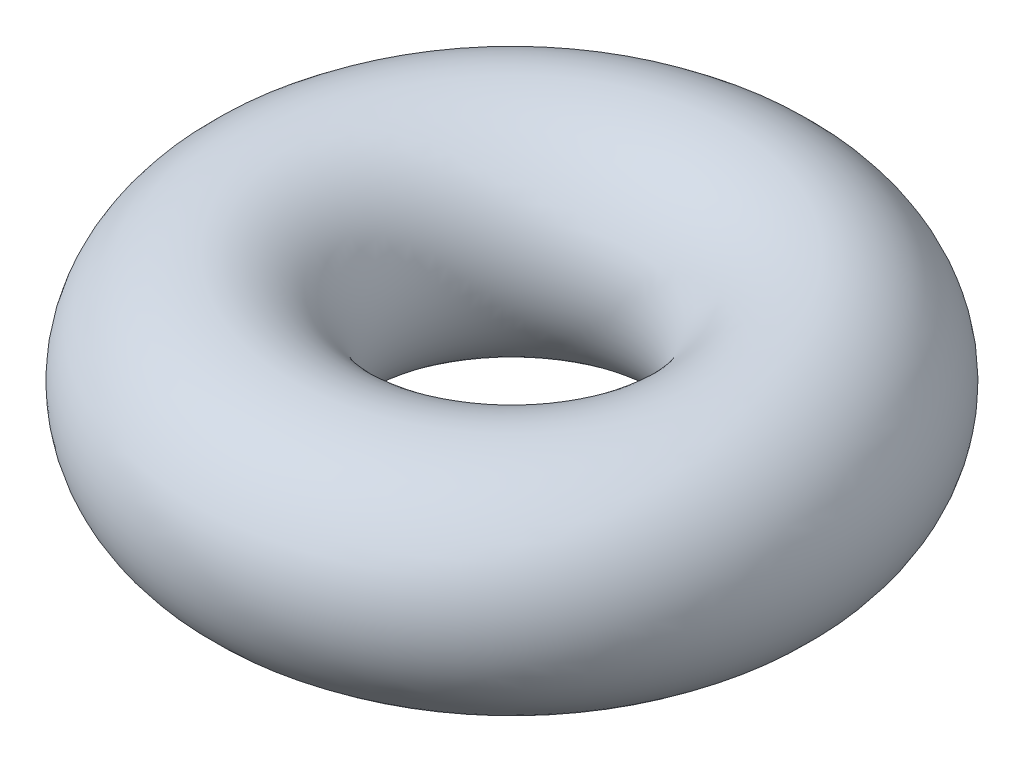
from build123d import *

# Parameters (mm, degrees)
SKETCH1_R = 0.889


with BuildPart() as part:
    # Sketch1 → Revolve1 (revolve)
    with BuildSketch(Plane.XY, mode=Mode.PRIVATE) as revolve1_sk:
        with Locations((-1.778, 0)):
            Circle(SKETCH1_R)
    revolve(revolve1_sk.sketch.rotate(Axis((0, 0, 0), (0, 1, 0)), 270), axis=Axis((0, 0, 0), (0, 1, 0)))


solid = part.part
